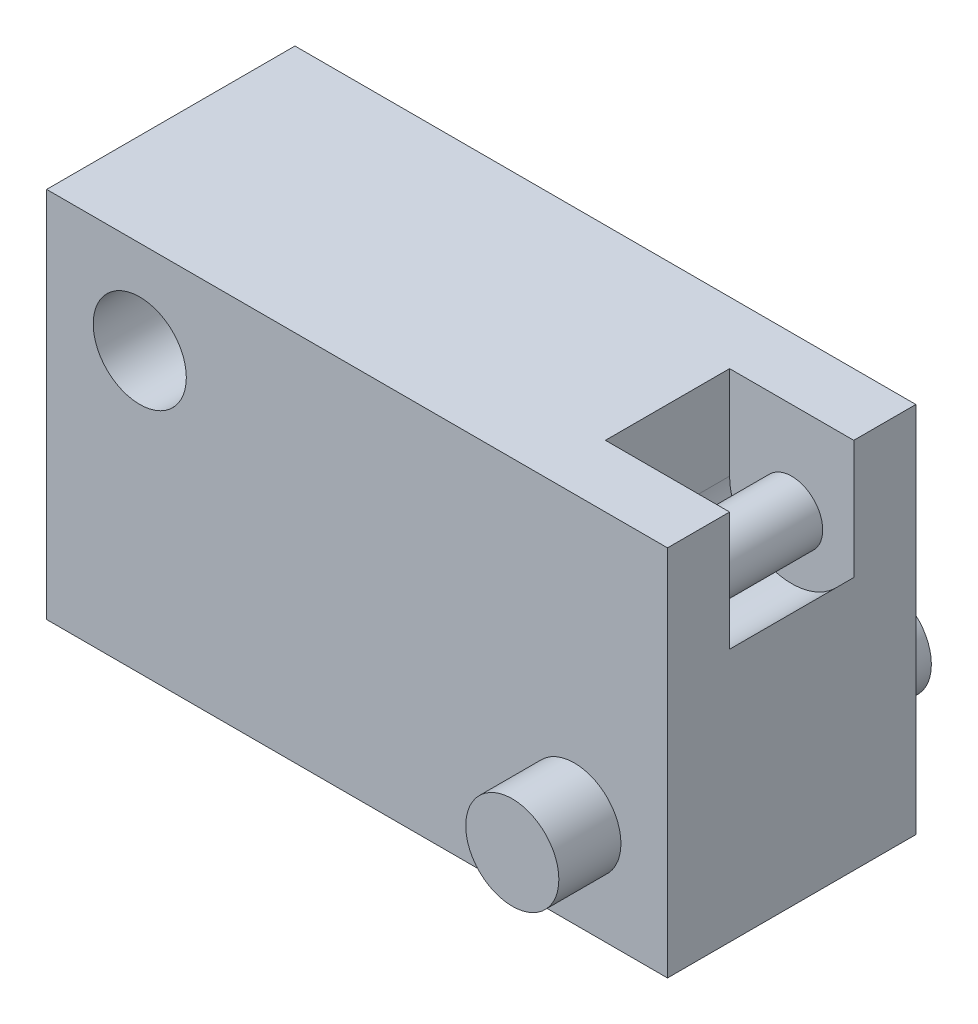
from build123d import *

# Parameters (mm, degrees)
ESQUISSE1_W          = 10
ESQUISSE1_H          = 6
PRISME_DE_BASE_DEPTH = 2
ESQUISSE2_R          = 0.75
PIONS_DEPTH          = 3
TROU_DEPTH           = 7.557438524
TROU_DEPTH_BACK      = 7.557438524
ESQUISSE3_R          = 0.75
ESQUISSE4_R          = 0.5
PASSAGE_LEVIER_DEPTH = 1


with BuildPart() as part:
    # Esquisse1 → Prisme de base (new, symmetric)
    with BuildSketch(Plane.XY):
        Rectangle(ESQUISSE1_W, ESQUISSE1_H)
    extrude(amount=PRISME_DE_BASE_DEPTH, both=True)

    # Esquisse2 → Pions (add, symmetric)
    with BuildSketch(Plane.XY):
        with Locations((3.5, -1.5)):
            Circle(ESQUISSE2_R)
    extrude(amount=PIONS_DEPTH, both=True)

    # Esquisse3 → Trou (cut, two sides: drawn at the far end of the back side and taken through both)
    with BuildSketch(Plane.XY.offset(-TROU_DEPTH_BACK)):
        with Locations((-3.5, 1.5)):
            Circle(ESQUISSE3_R)
    extrude(amount=TROU_DEPTH + TROU_DEPTH_BACK, mode=Mode.SUBTRACT)

    # Esquisse4 → Passage levier (cut, symmetric)
    with BuildSketch(Plane.XY):
        with BuildLine():
            Line((3, 3), (3, 1.5))
            ThreePointArc((3, 1.5), (3.617316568, 0.576120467), (4.707106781, 0.792893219))
            Line((4.707106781, 0.792893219), (5, 1.085786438))
            Line((5, 1.085786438), (5, 3))
            Line((5, 3), (3, 3))
        make_face()
        with Locations((4, 1.5)):
            Circle(ESQUISSE4_R, mode=Mode.SUBTRACT)
    extrude(amount=PASSAGE_LEVIER_DEPTH, both=True, mode=Mode.SUBTRACT)


solid = part.part
